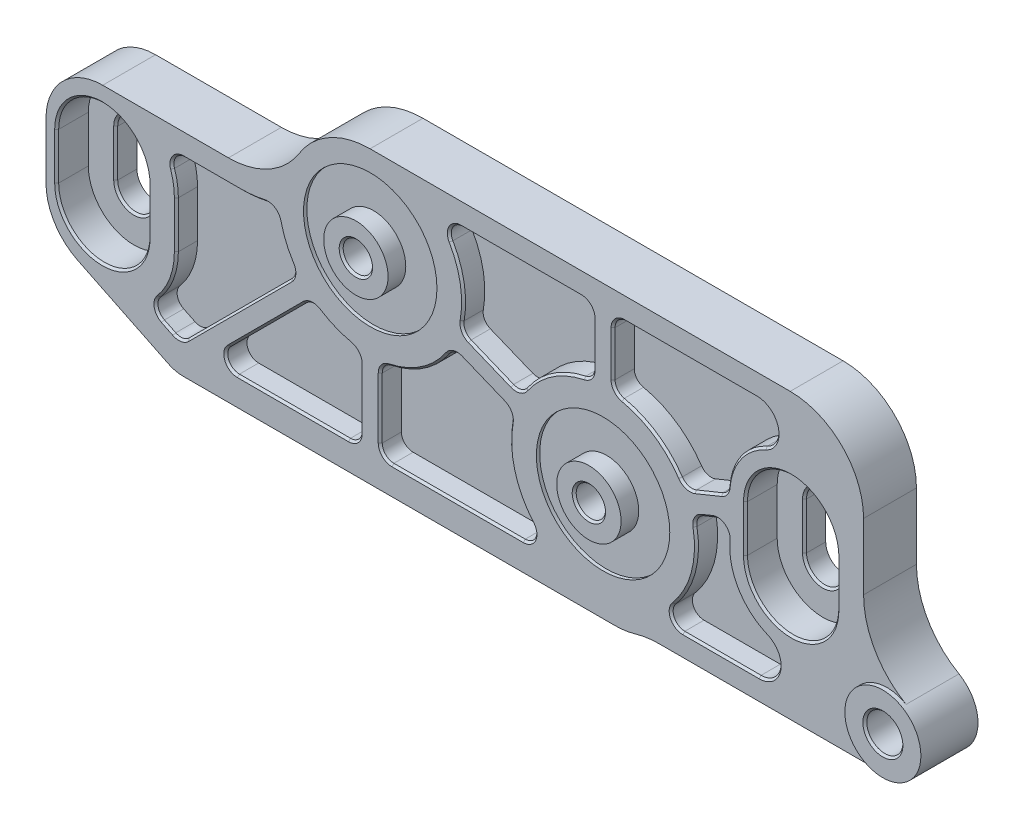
from build123d import *

# Parameters (mm, degrees)
EXTRUDE1_DEPTH          = 15.85
SKETCH2_R               = 20
CUT_EXTRUDE1_DEPTH      = 1
SKETCH3_R               = 9.65
EXTRUDE2_DEPTH          = 5.3
CUT_EXTRUDE2_DEPTH      = 9.5
EXTRUDE4_START          = 1.27
SKETCH14_R              = 11.4
EXTRUDE4_DEPTH          = 1.27
M12X1_25_TAPPED_HOLE1_D = 10.8
M10X1_25_TAPPED_HOLE1_D = 8.8
LW_POCKETS_DEPTH        = 6.35
CHAMFER3_SIZE           = 0.6


with BuildPart() as part:
    # Sketch1 → Extrude1 (new body)
    with BuildSketch(Plane.XY):
        with BuildLine():
            Line((252.15, 1.9), (183.805904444, 1.9))
            ThreePointArc((183.805904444, 1.9), (180.19965986, 1.643712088), (176.665904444, 0.88))
            ThreePointArc((176.665904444, 0.88), (173.617174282, 0.221111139), (170.505904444, 0))
            Line((170.505904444, 0), (41, 0))
            ThreePointArc((41, 0), (38.862964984, 0.243484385), (36.835474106, 0.96145656))
            Line((36.835474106, 0.96145656), (9.547690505, 14.270597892))
            ThreePointArc((9.547690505, 14.270597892), (2.583182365, 20.541469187), (0, 29.550096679))
            Line((0, 29.550096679), (0, 46.5))
            ThreePointArc((0, 46.5), (4.97918472, 58.52081528), (17, 63.5))
            Line((17, 63.5), (54.7, 63.5))
            ThreePointArc((54.7, 63.5), (66.839902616, 66.64541777), (75.925, 75.290178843))
            ThreePointArc((75.925, 75.290178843), (85.010097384, 83.934939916), (97.15, 87.080357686))
            Line((97.15, 87.080357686), (223.1, 87.080357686))
            ThreePointArc((223.1, 87.080357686), (238.656349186, 80.636706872), (245.1, 65.080357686))
            Line((245.1, 65.080357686), (245.1, 45.2563374))
            ThreePointArc((245.1, 45.2563374), (248.516352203, 32.5063374), (257.85, 23.172689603))
            ThreePointArc((257.85, 23.172689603), (263.16155442, 10.349462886), (252.15, 1.9))
        make_face()
        with BuildLine():
            Line((11.4, 45.02504834), (11.4, 31.02504834))
            ThreePointArc((11.4, 31.02504834), (16.9, 25.52504834), (22.4, 31.02504834))
            Line((22.4, 31.02504834), (22.4, 45.02504834))
            ThreePointArc((22.4, 45.02504834), (16.9, 50.52504834), (11.4, 45.02504834))
        make_face(mode=Mode.SUBTRACT)
        with BuildLine():
            Line((217.9, 51.4777), (217.9, 37.4777))
            ThreePointArc((217.9, 37.4777), (223.4, 31.9777), (228.9, 37.4777))
            Line((228.9, 37.4777), (228.9, 51.4777))
            ThreePointArc((228.9, 51.4777), (223.4, 56.9777), (217.9, 51.4777))
        make_face(mode=Mode.SUBTRACT)
    extrude(amount=-EXTRUDE1_DEPTH)

    # Sketch2 → Cut-Extrude1 (cut)
    with BuildSketch(Plane.XY):
        with Locations((97.2, 60.9)):
            Circle(SKETCH2_R)
        with Locations((167, 32.4)):
            Circle(SKETCH2_R)
    extrude(amount=-CUT_EXTRUDE1_DEPTH, mode=Mode.SUBTRACT)

    # Sketch3 → Extrude2 (add)
    with BuildSketch(Plane.XY.offset(-1)):
        with Locations((97.2, 60.9)):
            Circle(SKETCH3_R)
        with Locations((167.05, 32.3)):
            Circle(SKETCH3_R)
    extrude(amount=EXTRUDE2_DEPTH)

    # Sketch4 → Cut-Extrude2 (cut)
    with BuildSketch(Plane.XY):
        with BuildLine():
            Line((30.6, 30.9), (30.6, 44.85))
            ThreePointArc((30.6, 44.85), (16.9, 58.55), (3.2, 44.85))
            Line((3.2, 44.85), (3.2, 30.9))
            ThreePointArc((3.2, 30.9), (16.9, 17.2), (30.6, 30.9))
        make_face()
        with BuildLine():
            Line((209.7, 51.45), (209.7, 37.5))
            ThreePointArc((209.7, 37.5), (223.4, 23.8), (237.1, 37.5))
            Line((237.1, 37.5), (237.1, 51.45))
            ThreePointArc((237.1, 51.45), (223.4, 65.15), (209.7, 51.45))
        make_face()
    extrude(amount=-CUT_EXTRUDE2_DEPTH, mode=Mode.SUBTRACT)

    # Sketch14 → Extrude4 (add)
    with BuildSketch(Plane.XY.offset(EXTRUDE4_START)):
        with Locations((252.15, 13.3)):
            Circle(SKETCH14_R)
    extrude(amount=-EXTRUDE4_DEPTH)

    # M12x1.25 Tapped Hole1 (through all)
    with Locations(Plane(origin=(-1.635430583, 0.940133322, 1.27), x_dir=(1, 0, 0), z_dir=(0, 0, 1))):
        with Locations((253.785430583, 12.359866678)):
            Hole(M12X1_25_TAPPED_HOLE1_D / 2)

    # M10x1.25 Tapped Hole1 (through all)
    with Locations(Plane.XY.offset(4.3)):
        with Locations((97.2, 60.9), (167.05, 32.3)):
            Hole(M10X1_25_TAPPED_HOLE1_D / 2)

    # Sketch5 → LW Pockets (cut)
    with BuildSketch(Plane.XY):
        with BuildLine():
            Line((58.34912741, 56.7), (41.24911824, 56.7))
            ThreePointArc((41.24911824, 56.7), (38.407558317, 55.243413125), (37.931129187, 52.086021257))
            ThreePointArc((37.931129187, 52.086021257), (38.79448914, 48.602348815), (39.084808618, 45.02504834))
            Line((39.084808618, 45.02504834), (39.084808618, 31.02504834))
            ThreePointArc((39.084808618, 31.02504834), (37.721167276, 23.367063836), (33.797882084, 16.650511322))
            ThreePointArc((33.797882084, 16.650511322), (33.037833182, 13.66657419), (34.929487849, 11.236924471))
            Line((34.929487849, 11.236924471), (38.308138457, 9.589046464))
            ThreePointArc((38.308138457, 9.589046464), (40.420104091, 9.282826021), (42.317311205, 10.259951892))
            Line((42.317311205, 10.259951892), (73.284184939, 41.226825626))
            ThreePointArc((73.284184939, 41.226825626), (74.290428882, 43.338629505), (73.74160996, 45.612621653))
            ThreePointArc((73.74160996, 45.612621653), (71.387767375, 50.049716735), (69.864538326, 54.835963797))
            ThreePointArc((69.864538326, 54.835963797), (68.331182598, 57.027897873), (65.697548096, 57.496645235))
            ThreePointArc((65.697548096, 57.496645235), (62.044865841, 56.899743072), (58.34912741, 56.7))
        make_face()
        with BuildLine():
            Line((57.392388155, 8.4), (90.7, 8.4))
            ThreePointArc((90.7, 8.4), (93.174873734, 9.425126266), (94.2, 11.9))
            Line((94.2, 11.9), (94.2, 30.077929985))
            ThreePointArc((94.2, 30.077929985), (93.418251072, 32.282722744), (91.422222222, 33.502604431))
            ThreePointArc((91.422222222, 33.502604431), (86.484863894, 35.03137309), (81.912621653, 37.44160996))
            ThreePointArc((81.912621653, 37.44160996), (79.638629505, 37.990428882), (77.526825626, 36.984184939))
            Line((77.526825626, 36.984184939), (54.917514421, 14.374873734))
            ThreePointArc((54.917514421, 14.374873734), (54.158809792, 10.560607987), (57.392388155, 8.4))
        make_face()
        with BuildLine():
            Line((103.7, 8.4), (143.083478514, 8.4))
            ThreePointArc((143.083478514, 8.4), (146.263275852, 10.437505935), (145.74086979, 14.177777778))
            ThreePointArc((145.74086979, 14.177777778), (139.973097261, 25.082450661), (139.451408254, 37.407503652))
            ThreePointArc((139.451408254, 37.407503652), (139.076566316, 39.716558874), (137.33087982, 41.2737426))
            Line((137.33087982, 41.2737426), (124.601042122, 46.4714557))
            ThreePointArc((124.601042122, 46.4714557), (122.264333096, 46.581152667), (120.380441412, 45.194359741))
            ThreePointArc((120.380441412, 45.194359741), (112.814701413, 37.658203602), (102.977777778, 33.502604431))
            ThreePointArc((102.977777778, 33.502604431), (100.981748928, 32.282722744), (100.2, 30.077929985))
            Line((100.2, 30.077929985), (100.2, 11.9))
            ThreePointArc((100.2, 11.9), (101.225126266, 9.425126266), (103.7, 8.4))
        make_face()
        with BuildLine():
            Line((164, 63.222070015), (164, 76.780357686))
            ThreePointArc((164, 76.780357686), (162.974873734, 79.25523142), (160.5, 80.280357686))
            Line((160.5, 80.280357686), (124.404121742, 80.280357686))
            ThreePointArc((124.404121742, 80.280357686), (121.368854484, 78.523100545), (121.381441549, 75.015873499))
            ThreePointArc((121.381441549, 75.015873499), (124.775804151, 65.755411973), (124.748591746, 55.892496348))
            ThreePointArc((124.748591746, 55.892496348), (125.123433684, 53.583441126), (126.86912018, 52.0262574))
            Line((126.86912018, 52.0262574), (139.598957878, 46.8285443))
            ThreePointArc((139.598957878, 46.8285443), (141.935666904, 46.718847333), (143.819558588, 48.105640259))
            ThreePointArc((143.819558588, 48.105640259), (151.385298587, 55.641796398), (161.222222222, 59.797395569))
            ThreePointArc((161.222222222, 59.797395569), (163.218251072, 61.017277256), (164, 63.222070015))
        make_face()
        with BuildLine():
            Line((213.151156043, 80.280357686), (173.5, 80.280357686))
            ThreePointArc((173.5, 80.280357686), (171.025126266, 79.25523142), (170, 76.780357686))
            Line((170, 76.780357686), (170, 63.222070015))
            ThreePointArc((170, 63.222070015), (170.781748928, 61.017277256), (172.777777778, 59.797395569))
            ThreePointArc((172.777777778, 59.797395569), (182.614701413, 55.641796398), (190.180441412, 48.105640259))
            ThreePointArc((190.180441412, 48.105640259), (192.064333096, 46.718847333), (194.401042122, 46.8285443))
            Line((194.401042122, 46.8285443), (202.296360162, 50.05227731))
            ThreePointArc((202.296360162, 50.05227731), (203.797388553, 51.225066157), (204.461910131, 53.010263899))
            ThreePointArc((204.461910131, 53.010263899), (207.876602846, 62.433252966), (215.610878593, 68.807719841))
            ThreePointArc((215.610878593, 68.807719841), (219.01783428, 75.538167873), (213.151156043, 80.280357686))
        make_face()
        with BuildLine():
            Line((196.66912018, 41.2737426), (200.103216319, 42.675916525))
            ThreePointArc((200.103216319, 42.675916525), (203.229042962, 42.276212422), (204.496590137, 39.391098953))
            ThreePointArc((204.496590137, 39.391098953), (207.080185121, 27.74817574), (216.093724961, 19.938648))
            ThreePointArc((216.093724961, 19.938648), (219.670011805, 13.223540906), (213.786480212, 8.4))
            Line((213.786480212, 8.4), (190.916521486, 8.4))
            ThreePointArc((190.916521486, 8.4), (187.736724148, 10.437505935), (188.25913021, 14.177777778))
            ThreePointArc((188.25913021, 14.177777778), (194.026902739, 25.082450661), (194.548591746, 37.407503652))
            ThreePointArc((194.548591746, 37.407503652), (194.923433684, 39.716558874), (196.66912018, 41.2737426))
        make_face()
    extrude(amount=-LW_POCKETS_DEPTH, mode=Mode.SUBTRACT)

    # Chamfer3
    chamfer3_edges = [part.edges().sort_by_distance(p)[0] for p in [
        (30.6, 37.875, 0),
        (16.9, 58.55, 0),
        (3.2, 37.875, 0),
        (16.9, 50.52504834, -9.5),
        (22.4, 38.02504834, -9.5),
        (16.9, 25.52504834, -9.5),
        (217.9, 44.4777, -9.5),
        (223.4, 65.15, 0),
        (209.7, 44.475, 0),
        (223.4, 23.8, 0),
        (237.1, 44.475, 0),
        (223.4, 56.9777, -9.5),
        (228.9, 44.4777, -9.5),
        (223.4, 31.9777, -9.5),
        (257.55, 13.3, 1.27),
        (171.45, 32.3, 4.3),
        (101.6, 60.9, 4.3),
        (54.158809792, 10.560607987, 0),
        (74.046194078, 8.4, 0),
        (93.174873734, 9.425126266, 0),
        (94.2, 20.988964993, 0),
        (93.418251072, 32.282722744, 0),
        (86.484863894, 35.03137309, 0),
        (79.638629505, 37.990428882, 0),
        (66.222170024, 25.679529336, 0),
        (71.387767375, 50.049716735, 0),
        (68.331182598, 57.027897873, 0),
        (62.044865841, 56.899743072, 0),
        (49.799122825, 56.7, 0),
        (38.407558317, 55.243413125, 0),
        (38.79448914, 48.602348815, 0),
        (39.084808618, 38.02504834, 0),
        (37.721167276, 23.367063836, 0),
        (33.037833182, 13.66657419, 0),
        (36.618813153, 10.412985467, 0),
        (40.420104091, 9.282826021, 0),
        (57.800748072, 25.743388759, 0),
        (74.290428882, 43.338629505, 0),
        (101.225126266, 9.425126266, 0),
        (123.391739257, 8.4, 0),
        (146.263275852, 10.437505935, 0),
        (139.973097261, 25.082450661, 0),
        (139.076566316, 39.716558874, 0),
        (130.965960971, 43.87259915, 0),
        (122.264333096, 46.581152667, 0),
        (112.814701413, 37.658203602, 0),
        (100.981748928, 32.282722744, 0),
        (100.2, 20.988964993, 0),
        (163.218251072, 61.017277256, 0),
        (164, 70.00121385, 0),
        (162.974873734, 79.25523142, 0),
        (142.452060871, 80.280357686, 0),
        (121.368854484, 78.523100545, 0),
        (124.775804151, 65.755411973, 0),
        (125.123433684, 53.583441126, 0),
        (133.234039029, 49.42740085, 0),
        (141.935666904, 46.718847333, 0),
        (151.385298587, 55.641796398, 0),
        (203.229042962, 42.276212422, 0),
        (198.386168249, 41.974829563, 0),
        (194.923433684, 39.716558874, 0),
        (194.026902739, 25.082450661, 0),
        (187.736724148, 10.437505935, 0),
        (202.351500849, 8.4, 0),
        (219.670011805, 13.223540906, 0),
        (207.080185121, 27.74817574, 0),
        (171.025126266, 79.25523142, 0),
        (170, 70.00121385, 0),
        (170.781748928, 61.017277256, 0),
        (182.614701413, 55.641796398, 0),
        (192.064333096, 46.718847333, 0),
        (198.348701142, 48.440410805, 0),
        (203.797388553, 51.225066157, 0),
        (207.876602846, 62.433252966, 0),
        (219.01783428, 75.538167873, 0),
        (193.325578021, 80.280357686, 0),
        (11.4, 38.02504834, -9.5),
        (16.9, 17.2, 0),
    ]]
    chamfer(chamfer3_edges, length=CHAMFER3_SIZE)


solid = part.part
